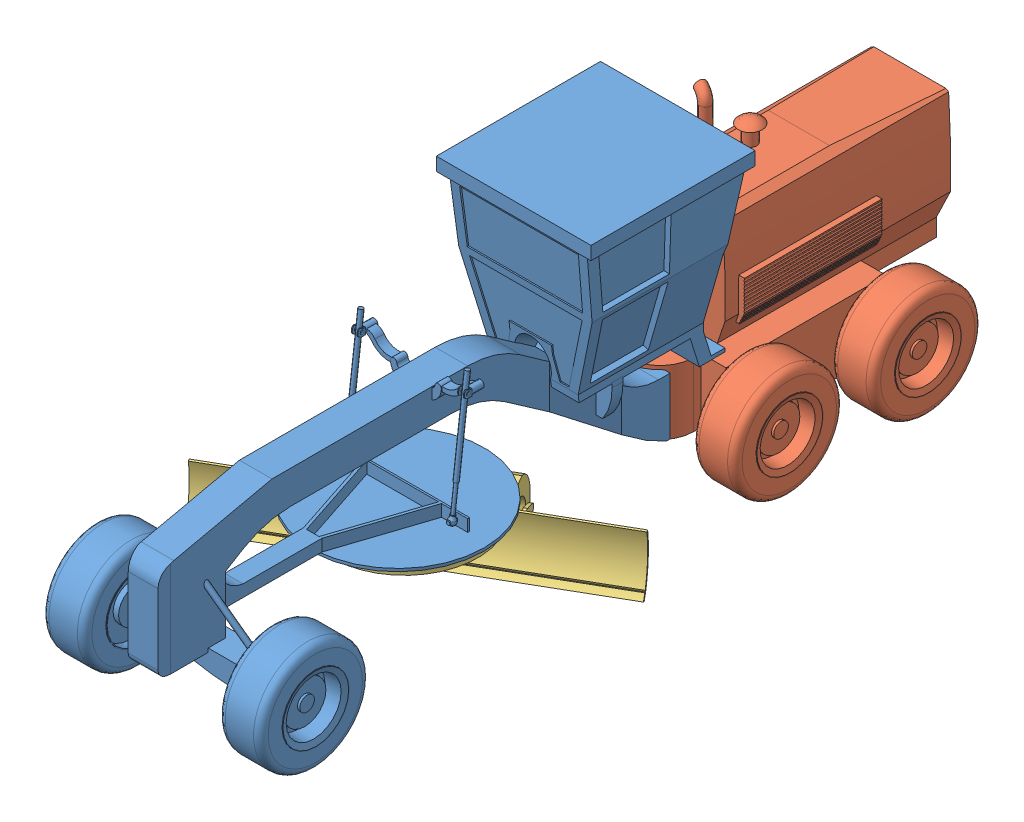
SolidWorks assembly niveleuse_jaune.SLDASM, configuration Default (file format 8000). Lengths in mm.
Overall size (3243.15 3110 8360).
3 component instances, 3 part files, 0 mates.
Components (placement in the parent):
- niveleuse_jaune_01-1: niveleuse_jaune_01.SLDPRT [Default] at origin size (2402 3110 5861.44)
- niveleuse_jaune_02-1: niveleuse_jaune_02.SLDPRT [Default] at origin size (2402 2937.42 3104)
- niveleuse_jaune_03-1: niveleuse_jaune_03.SLDPRT [Default] at origin size (3243.15 868.58 2092.93)
